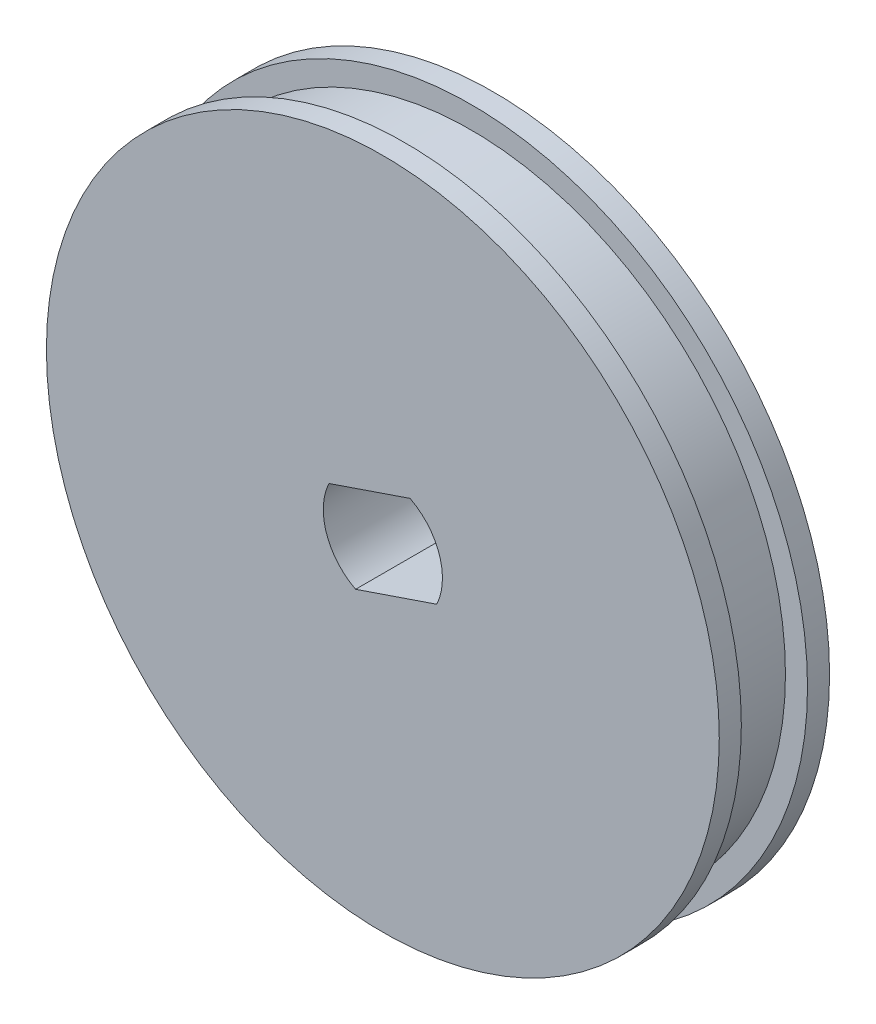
from build123d import *

# Parameters (mm, degrees)
SKETCH_1_R          = 14.25
EXTRUDE_1_DEPTH     = 1.5
SKETCH_2_R          = 15.25
EXTRUDE_2_DEPTH     = 1
CUT_EXTRUDE_1_DEPTH = 48.773575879


with BuildPart() as part:
    # Sketch 1 → Extrude 1 (new, symmetric)
    with BuildSketch(Plane.XY):
        with Locations((22.416532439, -13.707674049)):
            Circle(SKETCH_1_R)
    extrude(amount=EXTRUDE_1_DEPTH, both=True)

    # Sketch 2 → Extrude 2 (add)
    with BuildSketch(Plane.XY.offset(1.5)):
        with Locations((22.416532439, -13.707674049)):
            Circle(SKETCH_2_R)
    extrude_2 = extrude(amount=EXTRUDE_2_DEPTH)

    # Mirror 1: Extrude 2 across plane
    add(extrude_2.mirror(Plane.XY))

    # Sketch 3 → Cut-Extrude 1 (cut, through all)
    with BuildSketch(Plane.XY.offset(2.5)):
        with BuildLine():
            Line((23.651051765, -11.30643228), (19.972985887, -12.559161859))
            ThreePointArc((19.972985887, -12.559161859), (19.860709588, -14.578173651), (21.182013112, -16.108915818))
            Line((21.182013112, -16.108915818), (24.86007899, -14.856186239))
            ThreePointArc((24.86007899, -14.856186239), (24.972355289, -12.837174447), (23.651051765, -11.30643228))
        make_face()
    extrude(amount=-CUT_EXTRUDE_1_DEPTH, mode=Mode.SUBTRACT)


solid = part.part
